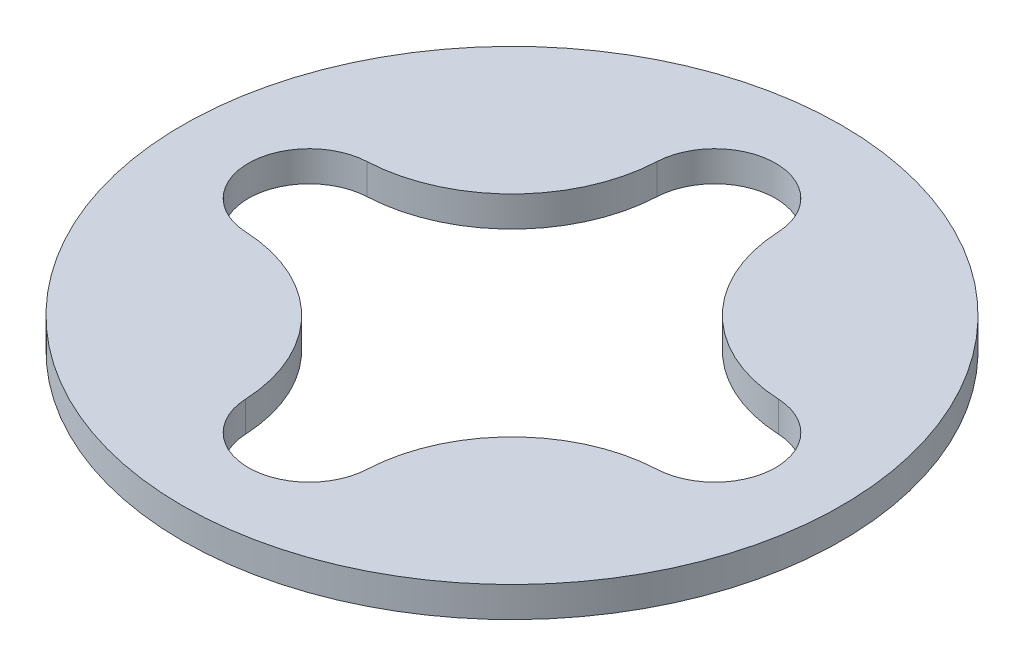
ISO-10303-21;
HEADER;
FILE_DESCRIPTION(('STEP AP214'),'2;1');
FILE_NAME('part.step','',(''),(''),'','','');
FILE_SCHEMA(('AUTOMOTIVE_DESIGN { 1 0 10303 214 1 1 1 1 }'));
ENDSEC;
DATA;
#1=APPLICATION_CONTEXT('core data for automotive mechanical design processes');
#2=APPLICATION_PROTOCOL_DEFINITION('international standard','automotive_design',2000,#1);
#3=PRODUCT_CONTEXT('',#1,'mechanical');
#4=PRODUCT('Part','Part','',(#3));
#5=PRODUCT_RELATED_PRODUCT_CATEGORY('part','',(#4));
#6=PRODUCT_DEFINITION_FORMATION('','',#4);
#7=PRODUCT_DEFINITION_CONTEXT('part definition',#1,'design');
#8=PRODUCT_DEFINITION('design','',#6,#7);
#9=PRODUCT_DEFINITION_SHAPE('','',#8);
#10=(LENGTH_UNIT() NAMED_UNIT(*) SI_UNIT(.MILLI.,.METRE.));
#11=(NAMED_UNIT(*) PLANE_ANGLE_UNIT() SI_UNIT($,.RADIAN.));
#12=(NAMED_UNIT(*) SI_UNIT($,.STERADIAN.) SOLID_ANGLE_UNIT());
#13=UNCERTAINTY_MEASURE_WITH_UNIT(LENGTH_MEASURE(1.E-05),#10,'distance_accuracy_value','');
#14=(GEOMETRIC_REPRESENTATION_CONTEXT(3) GLOBAL_UNCERTAINTY_ASSIGNED_CONTEXT((#13)) GLOBAL_UNIT_ASSIGNED_CONTEXT((#10,
#11,#12)) REPRESENTATION_CONTEXT('',''));
#15=CARTESIAN_POINT('',(0.,0.,0.));
#16=DIRECTION('',(0.,0.,1.));
#17=DIRECTION('',(1.,0.,0.));
#18=AXIS2_PLACEMENT_3D('',#15,#16,#17);
#19=CARTESIAN_POINT('',(0.,3.,0.));
#20=DIRECTION('',(0.,1.,0.));
#21=DIRECTION('',(0.,0.,1.));
#22=AXIS2_PLACEMENT_3D('',#19,#20,#21);
#23=PLANE('',#22);
#24=CARTESIAN_POINT('',(0.,3.,0.));
#25=DIRECTION('',(0.,1.,0.));
#26=DIRECTION('',(0.,0.,1.));
#27=AXIS2_PLACEMENT_3D('',#24,#25,#26);
#28=CIRCLE('',#27,32.5);
#29=CARTESIAN_POINT('',(0.,3.,32.5));
#30=VERTEX_POINT('',#29);
#31=EDGE_CURVE('E11',#30,#30,#28,.T.);
#32=ORIENTED_EDGE('',*,*,#31,.T.);
#33=EDGE_LOOP('',(#32));
#34=FACE_BOUND('',#33,.T.);
#35=CARTESIAN_POINT('',(20.,3.,0.));
#36=DIRECTION('',(0.,1.,0.));
#37=DIRECTION('',(0.,0.,1.));
#38=AXIS2_PLACEMENT_3D('',#35,#36,#37);
#39=CIRCLE('',#38,6.);
#40=CARTESIAN_POINT('',(20.2792140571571,3.,5.99349977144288));
#41=VERTEX_POINT('',#40);
#42=CARTESIAN_POINT('',(20.2792140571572,3.,-5.99349977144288));
#43=VERTEX_POINT('',#42);
#44=EDGE_CURVE('E104',#41,#43,#39,.T.);
#45=ORIENTED_EDGE('',*,*,#44,.F.);
#46=CARTESIAN_POINT('',(20.97724920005,3.,20.9772492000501));
#47=DIRECTION('',(0.,-1.,0.));
#48=DIRECTION('',(0.,0.,1.));
#49=AXIS2_PLACEMENT_3D('',#46,#47,#48);
#50=CIRCLE('',#49,15.);
#51=CARTESIAN_POINT('',(5.99349977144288,3.,20.2792140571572));
#52=VERTEX_POINT('',#51);
#53=EDGE_CURVE('E96',#52,#41,#50,.T.);
#54=ORIENTED_EDGE('',*,*,#53,.F.);
#55=CARTESIAN_POINT('',(0.,3.,20.));
#56=DIRECTION('',(0.,1.,0.));
#57=DIRECTION('',(0.,0.,1.));
#58=AXIS2_PLACEMENT_3D('',#55,#56,#57);
#59=CIRCLE('',#58,6.);
#60=CARTESIAN_POINT('',(-5.99349977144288,3.,20.2792140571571));
#61=VERTEX_POINT('',#60);
#62=EDGE_CURVE('E128',#61,#52,#59,.T.);
#63=ORIENTED_EDGE('',*,*,#62,.F.);
#64=CARTESIAN_POINT('',(-20.9772492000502,3.,20.9772492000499));
#65=DIRECTION('',(0.,-1.,0.));
#66=DIRECTION('',(0.,0.,1.));
#67=AXIS2_PLACEMENT_3D('',#64,#65,#66);
#68=CIRCLE('',#67,15.);
#69=CARTESIAN_POINT('',(-20.2792140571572,3.,5.99349977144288));
#70=VERTEX_POINT('',#69);
#71=EDGE_CURVE('E126',#70,#61,#68,.T.);
#72=ORIENTED_EDGE('',*,*,#71,.F.);
#73=CARTESIAN_POINT('',(-20.,3.,0.));
#74=DIRECTION('',(0.,1.,0.));
#75=DIRECTION('',(0.,0.,1.));
#76=AXIS2_PLACEMENT_3D('',#73,#74,#75);
#77=CIRCLE('',#76,6.);
#78=CARTESIAN_POINT('',(-20.2792140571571,3.,-5.99349977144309));
#79=VERTEX_POINT('',#78);
#80=EDGE_CURVE('E124',#79,#70,#77,.T.);
#81=ORIENTED_EDGE('',*,*,#80,.F.);
#82=CARTESIAN_POINT('',(-20.9772492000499,3.,-20.9772492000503));
#83=DIRECTION('',(0.,-1.,0.));
#84=DIRECTION('',(0.,0.,1.));
#85=AXIS2_PLACEMENT_3D('',#82,#83,#84);
#86=CIRCLE('',#85,15.);
#87=CARTESIAN_POINT('',(-5.99349977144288,3.,-20.2792140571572));
#88=VERTEX_POINT('',#87);
#89=EDGE_CURVE('E122',#88,#79,#86,.T.);
#90=ORIENTED_EDGE('',*,*,#89,.F.);
#91=CARTESIAN_POINT('',(0.,3.,-20.));
#92=DIRECTION('',(0.,1.,0.));
#93=DIRECTION('',(0.,0.,1.));
#94=AXIS2_PLACEMENT_3D('',#91,#92,#93);
#95=CIRCLE('',#94,6.);
#96=CARTESIAN_POINT('',(5.99349977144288,3.,-20.2792140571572));
#97=VERTEX_POINT('',#96);
#98=EDGE_CURVE('E118',#97,#88,#95,.T.);
#99=ORIENTED_EDGE('',*,*,#98,.F.);
#100=CARTESIAN_POINT('',(20.9772492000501,3.,-20.9772492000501));
#101=DIRECTION('',(0.,-1.,0.));
#102=DIRECTION('',(0.,0.,1.));
#103=AXIS2_PLACEMENT_3D('',#100,#101,#102);
#104=CIRCLE('',#103,15.);
#105=EDGE_CURVE('E116',#43,#97,#104,.T.);
#106=ORIENTED_EDGE('',*,*,#105,.F.);
#107=EDGE_LOOP('',(#45,#54,#63,#72,#81,#90,#99,#106));
#108=FACE_BOUND('',#107,.T.);
#109=ADVANCED_FACE('F31',(#34,#108),#23,.T.);
#110=CARTESIAN_POINT('',(0.,0.,0.));
#111=DIRECTION('',(0.,1.,0.));
#112=DIRECTION('',(0.,0.,1.));
#113=AXIS2_PLACEMENT_3D('',#110,#111,#112);
#114=PLANE('',#113);
#115=CARTESIAN_POINT('',(0.,0.,0.));
#116=DIRECTION('',(0.,1.,0.));
#117=DIRECTION('',(0.,0.,1.));
#118=AXIS2_PLACEMENT_3D('',#115,#116,#117);
#119=CIRCLE('',#118,32.5);
#120=CARTESIAN_POINT('',(0.,0.,32.5));
#121=VERTEX_POINT('',#120);
#122=EDGE_CURVE('E35',#121,#121,#119,.T.);
#123=ORIENTED_EDGE('',*,*,#122,.F.);
#124=EDGE_LOOP('',(#123));
#125=FACE_BOUND('',#124,.T.);
#126=CARTESIAN_POINT('',(20.97724920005,0.,20.9772492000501));
#127=DIRECTION('',(0.,-1.,0.));
#128=DIRECTION('',(0.,0.,1.));
#129=AXIS2_PLACEMENT_3D('',#126,#127,#128);
#130=CIRCLE('',#129,15.);
#131=CARTESIAN_POINT('',(5.99349977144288,0.,20.2792140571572));
#132=VERTEX_POINT('',#131);
#133=CARTESIAN_POINT('',(20.2792140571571,0.,5.99349977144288));
#134=VERTEX_POINT('',#133);
#135=EDGE_CURVE('E54',#132,#134,#130,.T.);
#136=ORIENTED_EDGE('',*,*,#135,.T.);
#137=CARTESIAN_POINT('',(20.,0.,0.));
#138=DIRECTION('',(0.,1.,0.));
#139=DIRECTION('',(0.,0.,1.));
#140=AXIS2_PLACEMENT_3D('',#137,#138,#139);
#141=CIRCLE('',#140,6.);
#142=CARTESIAN_POINT('',(20.2792140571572,0.,-5.99349977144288));
#143=VERTEX_POINT('',#142);
#144=EDGE_CURVE('E111',#134,#143,#141,.T.);
#145=ORIENTED_EDGE('',*,*,#144,.T.);
#146=CARTESIAN_POINT('',(20.9772492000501,0.,-20.9772492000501));
#147=DIRECTION('',(0.,-1.,0.));
#148=DIRECTION('',(0.,0.,1.));
#149=AXIS2_PLACEMENT_3D('',#146,#147,#148);
#150=CIRCLE('',#149,15.);
#151=CARTESIAN_POINT('',(5.99349977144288,0.,-20.2792140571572));
#152=VERTEX_POINT('',#151);
#153=EDGE_CURVE('E132',#143,#152,#150,.T.);
#154=ORIENTED_EDGE('',*,*,#153,.T.);
#155=CARTESIAN_POINT('',(0.,0.,-20.));
#156=DIRECTION('',(0.,1.,0.));
#157=DIRECTION('',(0.,0.,1.));
#158=AXIS2_PLACEMENT_3D('',#155,#156,#157);
#159=CIRCLE('',#158,6.);
#160=CARTESIAN_POINT('',(-5.99349977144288,0.,-20.2792140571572));
#161=VERTEX_POINT('',#160);
#162=EDGE_CURVE('E135',#152,#161,#159,.T.);
#163=ORIENTED_EDGE('',*,*,#162,.T.);
#164=CARTESIAN_POINT('',(-20.9772492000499,0.,-20.9772492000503));
#165=DIRECTION('',(0.,-1.,0.));
#166=DIRECTION('',(0.,0.,1.));
#167=AXIS2_PLACEMENT_3D('',#164,#165,#166);
#168=CIRCLE('',#167,15.);
#169=CARTESIAN_POINT('',(-20.2792140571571,0.,-5.99349977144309));
#170=VERTEX_POINT('',#169);
#171=EDGE_CURVE('E138',#161,#170,#168,.T.);
#172=ORIENTED_EDGE('',*,*,#171,.T.);
#173=CARTESIAN_POINT('',(-20.,0.,0.));
#174=DIRECTION('',(0.,1.,0.));
#175=DIRECTION('',(0.,0.,1.));
#176=AXIS2_PLACEMENT_3D('',#173,#174,#175);
#177=CIRCLE('',#176,6.);
#178=CARTESIAN_POINT('',(-20.2792140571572,0.,5.99349977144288));
#179=VERTEX_POINT('',#178);
#180=EDGE_CURVE('E141',#170,#179,#177,.T.);
#181=ORIENTED_EDGE('',*,*,#180,.T.);
#182=CARTESIAN_POINT('',(-20.9772492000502,0.,20.9772492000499));
#183=DIRECTION('',(0.,-1.,0.));
#184=DIRECTION('',(0.,0.,1.));
#185=AXIS2_PLACEMENT_3D('',#182,#183,#184);
#186=CIRCLE('',#185,15.);
#187=CARTESIAN_POINT('',(-5.99349977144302,0.,20.2792140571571));
#188=VERTEX_POINT('',#187);
#189=EDGE_CURVE('E144',#179,#188,#186,.T.);
#190=ORIENTED_EDGE('',*,*,#189,.T.);
#191=CARTESIAN_POINT('',(0.,0.,20.));
#192=DIRECTION('',(0.,1.,0.));
#193=DIRECTION('',(0.,0.,1.));
#194=AXIS2_PLACEMENT_3D('',#191,#192,#193);
#195=CIRCLE('',#194,6.);
#196=EDGE_CURVE('E105',#188,#132,#195,.T.);
#197=ORIENTED_EDGE('',*,*,#196,.T.);
#198=EDGE_LOOP('',(#136,#145,#154,#163,#172,#181,#190,#197));
#199=FACE_BOUND('',#198,.T.);
#200=ADVANCED_FACE('F165',(#125,#199),#114,.F.);
#201=CARTESIAN_POINT('',(0.,3.,0.));
#202=DIRECTION('',(0.,-1.,0.));
#203=DIRECTION('',(0.,0.,-1.));
#204=AXIS2_PLACEMENT_3D('',#201,#202,#203);
#205=CYLINDRICAL_SURFACE('',#204,32.5);
#206=ORIENTED_EDGE('',*,*,#31,.F.);
#207=EDGE_LOOP('',(#206));
#208=FACE_BOUND('',#207,.T.);
#209=ORIENTED_EDGE('',*,*,#122,.T.);
#210=EDGE_LOOP('',(#209));
#211=FACE_BOUND('',#210,.T.);
#212=ADVANCED_FACE('F33',(#208,#211),#205,.T.);
#213=CARTESIAN_POINT('',(20.97724920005,3.,20.9772492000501));
#214=DIRECTION('',(0.,-1.,0.));
#215=DIRECTION('',(0.,0.,-1.));
#216=AXIS2_PLACEMENT_3D('',#213,#214,#215);
#217=CYLINDRICAL_SURFACE('',#216,15.);
#218=ORIENTED_EDGE('',*,*,#135,.F.);
#219=DIRECTION('',(0.,-1.,0.));
#220=VECTOR('',#219,1.);
#221=CARTESIAN_POINT('',(5.99349977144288,3.,20.2792140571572));
#222=LINE('',#221,#220);
#223=EDGE_CURVE('E100',#52,#132,#222,.T.);
#224=ORIENTED_EDGE('',*,*,#223,.F.);
#225=ORIENTED_EDGE('',*,*,#53,.T.);
#226=DIRECTION('',(0.,-1.,0.));
#227=VECTOR('',#226,1.);
#228=CARTESIAN_POINT('',(20.2792140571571,3.,5.99349977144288));
#229=LINE('',#228,#227);
#230=EDGE_CURVE('E99',#41,#134,#229,.T.);
#231=ORIENTED_EDGE('',*,*,#230,.T.);
#232=EDGE_LOOP('',(#218,#224,#225,#231));
#233=FACE_BOUND('',#232,.T.);
#234=ADVANCED_FACE('F98',(#233),#217,.T.);
#235=CARTESIAN_POINT('',(20.,3.,0.));
#236=DIRECTION('',(0.,-1.,0.));
#237=DIRECTION('',(0.,0.,-1.));
#238=AXIS2_PLACEMENT_3D('',#235,#236,#237);
#239=CYLINDRICAL_SURFACE('',#238,6.);
#240=ORIENTED_EDGE('',*,*,#144,.F.);
#241=ORIENTED_EDGE('',*,*,#230,.F.);
#242=ORIENTED_EDGE('',*,*,#44,.T.);
#243=DIRECTION('',(0.,-1.,0.));
#244=VECTOR('',#243,1.);
#245=CARTESIAN_POINT('',(20.2792140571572,3.,-5.99349977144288));
#246=LINE('',#245,#244);
#247=EDGE_CURVE('E112',#43,#143,#246,.T.);
#248=ORIENTED_EDGE('',*,*,#247,.T.);
#249=EDGE_LOOP('',(#240,#241,#242,#248));
#250=FACE_BOUND('',#249,.T.);
#251=ADVANCED_FACE('F108',(#250),#239,.F.);
#252=CARTESIAN_POINT('',(20.9772492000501,3.,-20.9772492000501));
#253=DIRECTION('',(0.,-1.,0.));
#254=DIRECTION('',(0.,0.,-1.));
#255=AXIS2_PLACEMENT_3D('',#252,#253,#254);
#256=CYLINDRICAL_SURFACE('',#255,15.);
#257=ORIENTED_EDGE('',*,*,#153,.F.);
#258=ORIENTED_EDGE('',*,*,#247,.F.);
#259=ORIENTED_EDGE('',*,*,#105,.T.);
#260=DIRECTION('',(0.,-1.,0.));
#261=VECTOR('',#260,1.);
#262=CARTESIAN_POINT('',(5.99349977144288,3.,-20.2792140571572));
#263=LINE('',#262,#261);
#264=EDGE_CURVE('E157',#97,#152,#263,.T.);
#265=ORIENTED_EDGE('',*,*,#264,.T.);
#266=EDGE_LOOP('',(#257,#258,#259,#265));
#267=FACE_BOUND('',#266,.T.);
#268=ADVANCED_FACE('F161',(#267),#256,.T.);
#269=CARTESIAN_POINT('',(0.,3.,-20.));
#270=DIRECTION('',(0.,-1.,0.));
#271=DIRECTION('',(0.,0.,-1.));
#272=AXIS2_PLACEMENT_3D('',#269,#270,#271);
#273=CYLINDRICAL_SURFACE('',#272,6.);
#274=ORIENTED_EDGE('',*,*,#162,.F.);
#275=ORIENTED_EDGE('',*,*,#264,.F.);
#276=ORIENTED_EDGE('',*,*,#98,.T.);
#277=DIRECTION('',(0.,-1.,0.));
#278=VECTOR('',#277,1.);
#279=CARTESIAN_POINT('',(-5.99349977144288,3.,-20.2792140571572));
#280=LINE('',#279,#278);
#281=EDGE_CURVE('E155',#88,#161,#280,.T.);
#282=ORIENTED_EDGE('',*,*,#281,.T.);
#283=EDGE_LOOP('',(#274,#275,#276,#282));
#284=FACE_BOUND('',#283,.T.);
#285=ADVANCED_FACE('F183',(#284),#273,.F.);
#286=CARTESIAN_POINT('',(-20.9772492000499,3.,-20.9772492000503));
#287=DIRECTION('',(0.,-1.,0.));
#288=DIRECTION('',(0.,0.,-1.));
#289=AXIS2_PLACEMENT_3D('',#286,#287,#288);
#290=CYLINDRICAL_SURFACE('',#289,15.);
#291=ORIENTED_EDGE('',*,*,#171,.F.);
#292=ORIENTED_EDGE('',*,*,#281,.F.);
#293=ORIENTED_EDGE('',*,*,#89,.T.);
#294=DIRECTION('',(0.,-1.,0.));
#295=VECTOR('',#294,1.);
#296=CARTESIAN_POINT('',(-20.2792140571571,3.,-5.99349977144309));
#297=LINE('',#296,#295);
#298=EDGE_CURVE('E153',#79,#170,#297,.T.);
#299=ORIENTED_EDGE('',*,*,#298,.T.);
#300=EDGE_LOOP('',(#291,#292,#293,#299));
#301=FACE_BOUND('',#300,.T.);
#302=ADVANCED_FACE('F180',(#301),#290,.T.);
#303=CARTESIAN_POINT('',(-20.,3.,0.));
#304=DIRECTION('',(0.,-1.,0.));
#305=DIRECTION('',(0.,0.,-1.));
#306=AXIS2_PLACEMENT_3D('',#303,#304,#305);
#307=CYLINDRICAL_SURFACE('',#306,6.);
#308=ORIENTED_EDGE('',*,*,#180,.F.);
#309=ORIENTED_EDGE('',*,*,#298,.F.);
#310=ORIENTED_EDGE('',*,*,#80,.T.);
#311=DIRECTION('',(0.,-1.,0.));
#312=VECTOR('',#311,1.);
#313=CARTESIAN_POINT('',(-20.2792140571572,3.,5.99349977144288));
#314=LINE('',#313,#312);
#315=EDGE_CURVE('E151',#70,#179,#314,.T.);
#316=ORIENTED_EDGE('',*,*,#315,.T.);
#317=EDGE_LOOP('',(#308,#309,#310,#316));
#318=FACE_BOUND('',#317,.T.);
#319=ADVANCED_FACE('F176',(#318),#307,.F.);
#320=CARTESIAN_POINT('',(-20.9772492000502,3.,20.9772492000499));
#321=DIRECTION('',(0.,-1.,0.));
#322=DIRECTION('',(0.,0.,-1.));
#323=AXIS2_PLACEMENT_3D('',#320,#321,#322);
#324=CYLINDRICAL_SURFACE('',#323,15.);
#325=ORIENTED_EDGE('',*,*,#189,.F.);
#326=ORIENTED_EDGE('',*,*,#315,.F.);
#327=ORIENTED_EDGE('',*,*,#71,.T.);
#328=DIRECTION('',(0.,-1.,0.));
#329=VECTOR('',#328,1.);
#330=CARTESIAN_POINT('',(-5.99349977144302,3.,20.2792140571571));
#331=LINE('',#330,#329);
#332=EDGE_CURVE('E46',#61,#188,#331,.T.);
#333=ORIENTED_EDGE('',*,*,#332,.T.);
#334=EDGE_LOOP('',(#325,#326,#327,#333));
#335=FACE_BOUND('',#334,.T.);
#336=ADVANCED_FACE('F173',(#335),#324,.T.);
#337=CARTESIAN_POINT('',(0.,3.,20.));
#338=DIRECTION('',(0.,-1.,0.));
#339=DIRECTION('',(0.,0.,-1.));
#340=AXIS2_PLACEMENT_3D('',#337,#338,#339);
#341=CYLINDRICAL_SURFACE('',#340,6.);
#342=ORIENTED_EDGE('',*,*,#196,.F.);
#343=ORIENTED_EDGE('',*,*,#332,.F.);
#344=ORIENTED_EDGE('',*,*,#62,.T.);
#345=ORIENTED_EDGE('',*,*,#223,.T.);
#346=EDGE_LOOP('',(#342,#343,#344,#345));
#347=FACE_BOUND('',#346,.T.);
#348=ADVANCED_FACE('F167',(#347),#341,.F.);
#349=CLOSED_SHELL('',(#109,#200,#212,#234,#251,#268,#285,#302,#319,#336,#348));
#350=MANIFOLD_SOLID_BREP('B2',#349);
#351=ADVANCED_BREP_SHAPE_REPRESENTATION('',(#18,#350),#14);
#352=SHAPE_DEFINITION_REPRESENTATION(#9,#351);
ENDSEC;
END-ISO-10303-21;
